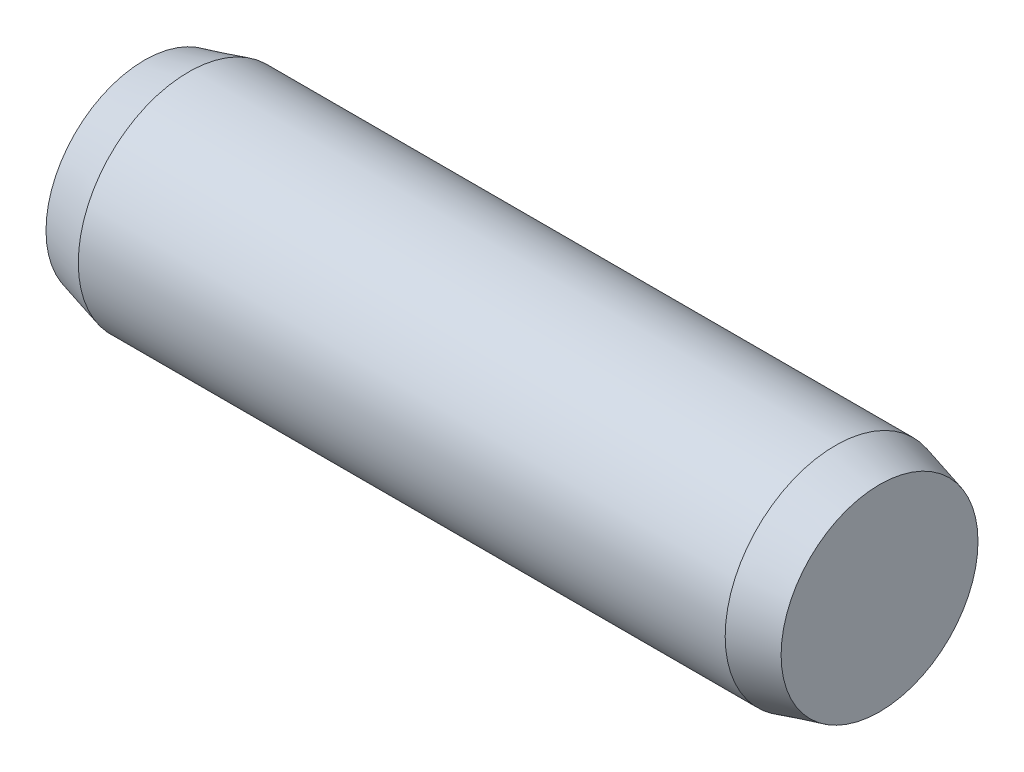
from build123d import *


with BuildPart() as part:
    # Sketch1 → Base-Revolve (revolve)
    with BuildSketch(Plane.XY, mode=Mode.PRIVATE) as base_revolve_sk:
        Polygon((0, 0), (20, 0), (20, 2.678460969), (18.8, 3), (1.2, 3), (0, 2.678460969), align=None)
    revolve(base_revolve_sk.sketch.rotate(Axis((-1.655717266, 0, 0), (1, 0, 0)), 90), axis=Axis((-1.655717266, 0, 0), (1, 0, 0)))


solid = part.part
